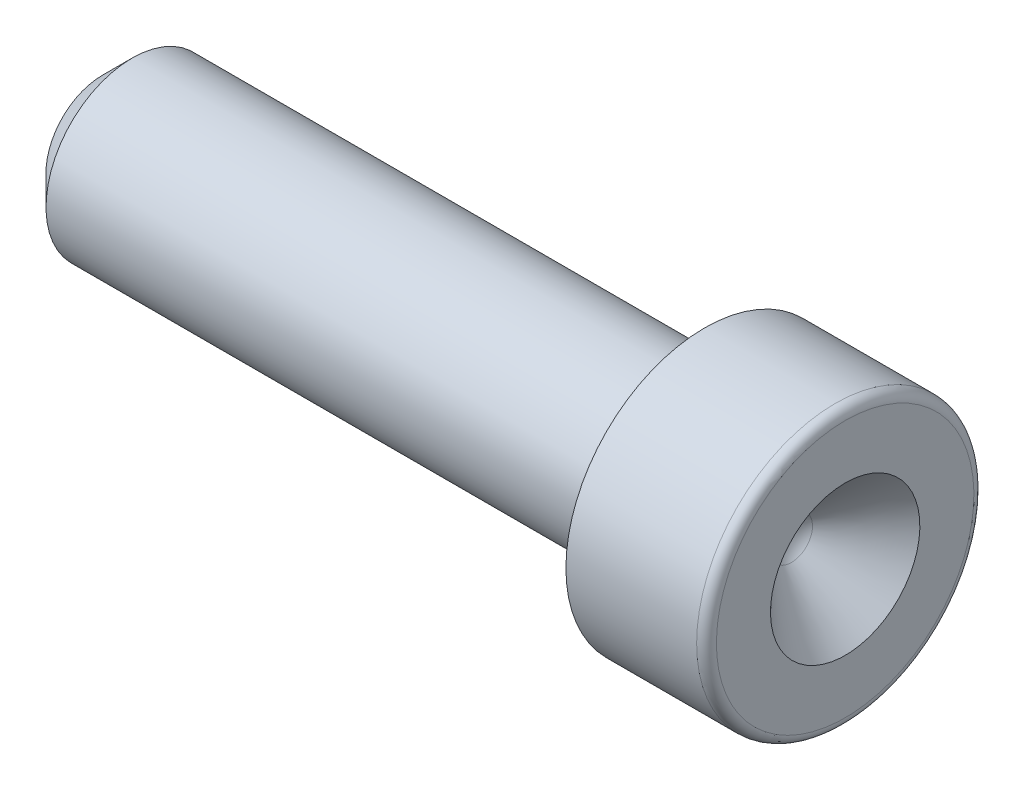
ISO-10303-21;
HEADER;
FILE_DESCRIPTION(('STEP AP214'),'2;1');
FILE_NAME('part.step','',(''),(''),'','','');
FILE_SCHEMA(('AUTOMOTIVE_DESIGN { 1 0 10303 214 1 1 1 1 }'));
ENDSEC;
DATA;
#1=APPLICATION_CONTEXT('core data for automotive mechanical design processes');
#2=APPLICATION_PROTOCOL_DEFINITION('international standard','automotive_design',2000,#1);
#3=PRODUCT_CONTEXT('',#1,'mechanical');
#4=PRODUCT('Part','Part','',(#3));
#5=PRODUCT_RELATED_PRODUCT_CATEGORY('part','',(#4));
#6=PRODUCT_DEFINITION_FORMATION('','',#4);
#7=PRODUCT_DEFINITION_CONTEXT('part definition',#1,'design');
#8=PRODUCT_DEFINITION('design','',#6,#7);
#9=PRODUCT_DEFINITION_SHAPE('','',#8);
#10=(LENGTH_UNIT() NAMED_UNIT(*) SI_UNIT(.MILLI.,.METRE.));
#11=(NAMED_UNIT(*) PLANE_ANGLE_UNIT() SI_UNIT($,.RADIAN.));
#12=(NAMED_UNIT(*) SI_UNIT($,.STERADIAN.) SOLID_ANGLE_UNIT());
#13=UNCERTAINTY_MEASURE_WITH_UNIT(LENGTH_MEASURE(1.E-05),#10,'distance_accuracy_value','');
#14=(GEOMETRIC_REPRESENTATION_CONTEXT(3) GLOBAL_UNCERTAINTY_ASSIGNED_CONTEXT((#13)) GLOBAL_UNIT_ASSIGNED_CONTEXT((#10,
#11,#12)) REPRESENTATION_CONTEXT('',''));
#15=CARTESIAN_POINT('',(0.,0.,0.));
#16=DIRECTION('',(0.,0.,1.));
#17=DIRECTION('',(1.,0.,0.));
#18=AXIS2_PLACEMENT_3D('',#15,#16,#17);
#19=CARTESIAN_POINT('',(19.05,0.,0.));
#20=DIRECTION('',(-1.,0.,0.));
#21=DIRECTION('',(0.,-1.,0.));
#22=AXIS2_PLACEMENT_3D('',#19,#20,#21);
#23=PLANE('',#22);
#24=CARTESIAN_POINT('',(19.05,-2.2098,0.));
#25=DIRECTION('',(1.,0.,0.));
#26=DIRECTION('',(0.,1.,0.));
#27=AXIS2_PLACEMENT_3D('',#24,#25,#26);
#28=CIRCLE('',#27,1.9158307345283);
#29=CARTESIAN_POINT('',(19.05,-0.293969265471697,0.));
#30=VERTEX_POINT('',#29);
#31=EDGE_CURVE('E64',#30,#30,#28,.T.);
#32=ORIENTED_EDGE('',*,*,#31,.F.);
#33=EDGE_LOOP('',(#32));
#34=FACE_BOUND('',#33,.T.);
#35=CARTESIAN_POINT('',(19.05,-2.2098,0.));
#36=DIRECTION('',(1.,0.,0.));
#37=DIRECTION('',(0.,1.,0.));
#38=AXIS2_PLACEMENT_3D('',#35,#36,#37);
#39=CIRCLE('',#38,3.302);
#40=CARTESIAN_POINT('',(19.05,1.0922,0.));
#41=VERTEX_POINT('',#40);
#42=EDGE_CURVE('E10',#41,#41,#39,.T.);
#43=ORIENTED_EDGE('',*,*,#42,.T.);
#44=EDGE_LOOP('',(#43));
#45=FACE_BOUND('',#44,.T.);
#46=ADVANCED_FACE('F33',(#34,#45),#23,.F.);
#47=CARTESIAN_POINT('',(18.796,-2.2098,0.));
#48=DIRECTION('',(1.,0.,0.));
#49=DIRECTION('',(0.,1.,0.));
#50=AXIS2_PLACEMENT_3D('',#47,#48,#49);
#51=TOROIDAL_SURFACE('',#50,3.302,0.254000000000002);
#52=CARTESIAN_POINT('',(18.796,-2.2098,0.));
#53=DIRECTION('',(1.,0.,0.));
#54=DIRECTION('',(0.,1.,0.));
#55=AXIS2_PLACEMENT_3D('',#52,#53,#54);
#56=CIRCLE('',#55,3.556);
#57=CARTESIAN_POINT('',(18.796,1.3462,0.));
#58=VERTEX_POINT('',#57);
#59=EDGE_CURVE('E39',#58,#58,#56,.T.);
#60=ORIENTED_EDGE('',*,*,#59,.T.);
#61=EDGE_LOOP('',(#60));
#62=FACE_BOUND('',#61,.T.);
#63=ORIENTED_EDGE('',*,*,#42,.F.);
#64=EDGE_LOOP('',(#63));
#65=FACE_BOUND('',#64,.T.);
#66=ADVANCED_FACE('F72',(#62,#65),#51,.T.);
#67=CARTESIAN_POINT('',(79.8278326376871,-2.20979999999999,0.));
#68=DIRECTION('',(1.,0.,0.));
#69=DIRECTION('',(0.,1.,0.));
#70=AXIS2_PLACEMENT_3D('',#67,#68,#69);
#71=CYLINDRICAL_SURFACE('',#70,3.556);
#72=ORIENTED_EDGE('',*,*,#59,.F.);
#73=EDGE_LOOP('',(#72));
#74=FACE_BOUND('',#73,.T.);
#75=CARTESIAN_POINT('',(15.4432,-2.2098,0.));
#76=DIRECTION('',(1.,0.,0.));
#77=DIRECTION('',(0.,1.,0.));
#78=AXIS2_PLACEMENT_3D('',#75,#76,#77);
#79=CIRCLE('',#78,3.556);
#80=CARTESIAN_POINT('',(15.4432,1.3462,0.));
#81=VERTEX_POINT('',#80);
#82=EDGE_CURVE('E43',#81,#81,#79,.T.);
#83=ORIENTED_EDGE('',*,*,#82,.T.);
#84=EDGE_LOOP('',(#83));
#85=FACE_BOUND('',#84,.T.);
#86=ADVANCED_FACE('F76',(#74,#85),#71,.T.);
#87=CARTESIAN_POINT('',(15.4432,0.,0.));
#88=DIRECTION('',(1.,0.,0.));
#89=DIRECTION('',(0.,1.,0.));
#90=AXIS2_PLACEMENT_3D('',#87,#88,#89);
#91=PLANE('',#90);
#92=ORIENTED_EDGE('',*,*,#82,.F.);
#93=EDGE_LOOP('',(#92));
#94=FACE_BOUND('',#93,.T.);
#95=CARTESIAN_POINT('',(15.4432,-2.2098,0.));
#96=DIRECTION('',(1.,0.,0.));
#97=DIRECTION('',(0.,1.,0.));
#98=AXIS2_PLACEMENT_3D('',#95,#96,#97);
#99=CIRCLE('',#98,2.7178);
#100=CARTESIAN_POINT('',(15.4432,0.508000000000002,0.));
#101=VERTEX_POINT('',#100);
#102=EDGE_CURVE('E47',#101,#101,#99,.T.);
#103=ORIENTED_EDGE('',*,*,#102,.T.);
#104=EDGE_LOOP('',(#103));
#105=FACE_BOUND('',#104,.T.);
#106=ADVANCED_FACE('F80',(#94,#105),#91,.F.);
#107=CARTESIAN_POINT('',(14.9352,-2.2098,0.));
#108=DIRECTION('',(1.,0.,0.));
#109=DIRECTION('',(0.,1.,0.));
#110=AXIS2_PLACEMENT_3D('',#107,#108,#109);
#111=TOROIDAL_SURFACE('',#110,2.7178,0.508000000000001);
#112=ORIENTED_EDGE('',*,*,#102,.F.);
#113=EDGE_LOOP('',(#112));
#114=FACE_BOUND('',#113,.T.);
#115=CARTESIAN_POINT('',(14.9352,-2.2098,0.));
#116=DIRECTION('',(1.,0.,0.));
#117=DIRECTION('',(0.,1.,0.));
#118=AXIS2_PLACEMENT_3D('',#115,#116,#117);
#119=CIRCLE('',#118,2.2098);
#120=CARTESIAN_POINT('',(14.9352,0.,0.));
#121=VERTEX_POINT('',#120);
#122=EDGE_CURVE('E52',#121,#121,#119,.T.);
#123=ORIENTED_EDGE('',*,*,#122,.T.);
#124=EDGE_LOOP('',(#123));
#125=FACE_BOUND('',#124,.T.);
#126=ADVANCED_FACE('F87',(#114,#125),#111,.F.);
#127=CARTESIAN_POINT('',(79.8278326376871,-2.20979999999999,0.));
#128=DIRECTION('',(1.,0.,0.));
#129=DIRECTION('',(0.,1.,0.));
#130=AXIS2_PLACEMENT_3D('',#127,#128,#129);
#131=CYLINDRICAL_SURFACE('',#130,2.2098);
#132=ORIENTED_EDGE('',*,*,#122,.F.);
#133=EDGE_LOOP('',(#132));
#134=FACE_BOUND('',#133,.T.);
#135=CARTESIAN_POINT('',(0.761999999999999,-2.2098,0.));
#136=DIRECTION('',(1.,0.,0.));
#137=DIRECTION('',(0.,1.,0.));
#138=AXIS2_PLACEMENT_3D('',#135,#136,#137);
#139=CIRCLE('',#138,2.2098);
#140=CARTESIAN_POINT('',(0.761999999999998,0.,0.));
#141=VERTEX_POINT('',#140);
#142=EDGE_CURVE('E55',#141,#141,#139,.T.);
#143=ORIENTED_EDGE('',*,*,#142,.T.);
#144=EDGE_LOOP('',(#143));
#145=FACE_BOUND('',#144,.T.);
#146=ADVANCED_FACE('F91',(#134,#145),#131,.T.);
#147=CARTESIAN_POINT('',(0.,-2.2098,0.));
#148=DIRECTION('',(1.,0.,0.));
#149=DIRECTION('',(0.,1.,0.));
#150=AXIS2_PLACEMENT_3D('',#147,#148,#149);
#151=CONICAL_SURFACE('',#150,1.4478,0.785398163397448);
#152=ORIENTED_EDGE('',*,*,#142,.F.);
#153=EDGE_LOOP('',(#152));
#154=FACE_BOUND('',#153,.T.);
#155=CARTESIAN_POINT('',(0.,-2.2098,0.));
#156=DIRECTION('',(1.,0.,0.));
#157=DIRECTION('',(0.,1.,0.));
#158=AXIS2_PLACEMENT_3D('',#155,#156,#157);
#159=CIRCLE('',#158,1.4478);
#160=CARTESIAN_POINT('',(0.,-0.761999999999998,0.));
#161=VERTEX_POINT('',#160);
#162=EDGE_CURVE('E58',#161,#161,#159,.T.);
#163=ORIENTED_EDGE('',*,*,#162,.T.);
#164=EDGE_LOOP('',(#163));
#165=FACE_BOUND('',#164,.T.);
#166=ADVANCED_FACE('F95',(#154,#165),#151,.T.);
#167=CARTESIAN_POINT('',(0.,0.,0.));
#168=DIRECTION('',(-1.,0.,0.));
#169=DIRECTION('',(0.,-1.,0.));
#170=AXIS2_PLACEMENT_3D('',#167,#168,#169);
#171=PLANE('',#170);
#172=ORIENTED_EDGE('',*,*,#162,.F.);
#173=EDGE_LOOP('',(#172));
#174=FACE_BOUND('',#173,.T.);
#175=ADVANCED_FACE('F99',(#174),#171,.T.);
#176=CARTESIAN_POINT('',(18.2118,-2.2098,0.));
#177=DIRECTION('',(1.,0.,0.));
#178=DIRECTION('',(0.,1.,0.));
#179=AXIS2_PLACEMENT_3D('',#176,#177,#178);
#180=SPHERICAL_SURFACE('',#179,0.762);
#181=CARTESIAN_POINT('',(17.6729846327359,-2.2098,0.));
#182=DIRECTION('',(1.,0.,0.));
#183=DIRECTION('',(0.,1.,0.));
#184=AXIS2_PLACEMENT_3D('',#181,#182,#183);
#185=CIRCLE('',#184,0.538815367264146);
#186=CARTESIAN_POINT('',(17.6729846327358,-1.67098463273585,0.));
#187=VERTEX_POINT('',#186);
#188=EDGE_CURVE('E61',#187,#187,#185,.T.);
#189=ORIENTED_EDGE('',*,*,#188,.T.);
#190=EDGE_LOOP('',(#189));
#191=FACE_BOUND('',#190,.T.);
#192=ADVANCED_FACE('F103',(#191),#180,.F.);
#193=CARTESIAN_POINT('',(17.6729846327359,-2.2098,0.));
#194=DIRECTION('',(1.,0.,0.));
#195=DIRECTION('',(0.,1.,0.));
#196=AXIS2_PLACEMENT_3D('',#193,#194,#195);
#197=CONICAL_SURFACE('',#196,0.538815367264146,0.78539816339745);
#198=CARTESIAN_POINT('',(19.05,-0.293969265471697,0.));
#199=CARTESIAN_POINT('',(19.0356560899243,-0.308313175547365,0.));
#200=CARTESIAN_POINT('',(19.0213121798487,-0.322657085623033,0.));
#201=CARTESIAN_POINT('',(18.9926243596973,-0.35134490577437,0.));
#202=CARTESIAN_POINT('',(18.9782804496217,-0.365688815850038,0.));
#203=CARTESIAN_POINT('',(18.9495926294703,-0.394376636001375,0.));
#204=CARTESIAN_POINT('',(18.9352487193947,-0.408720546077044,0.));
#205=CARTESIAN_POINT('',(18.9065608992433,-0.43740836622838,0.));
#206=CARTESIAN_POINT('',(18.8922169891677,-0.451752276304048,0.));
#207=CARTESIAN_POINT('',(18.8635291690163,-0.480440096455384,0.));
#208=CARTESIAN_POINT('',(18.8491852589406,-0.494784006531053,0.));
#209=CARTESIAN_POINT('',(18.8204974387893,-0.52347182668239,0.));
#210=CARTESIAN_POINT('',(18.8061535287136,-0.537815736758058,0.));
#211=CARTESIAN_POINT('',(18.7774657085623,-0.566503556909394,0.));
#212=CARTESIAN_POINT('',(18.7631217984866,-0.580847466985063,0.));
#213=CARTESIAN_POINT('',(18.7344339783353,-0.6095352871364,0.));
#214=CARTESIAN_POINT('',(18.7200900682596,-0.623879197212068,0.));
#215=CARTESIAN_POINT('',(18.6914022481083,-0.652567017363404,0.));
#216=CARTESIAN_POINT('',(18.6770583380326,-0.666910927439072,0.));
#217=CARTESIAN_POINT('',(18.6483705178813,-0.695598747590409,0.));
#218=CARTESIAN_POINT('',(18.6340266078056,-0.709942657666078,0.));
#219=CARTESIAN_POINT('',(18.6053387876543,-0.738630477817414,0.));
#220=CARTESIAN_POINT('',(18.5909948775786,-0.752974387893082,0.));
#221=CARTESIAN_POINT('',(18.5623070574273,-0.781662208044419,0.));
#222=CARTESIAN_POINT('',(18.5479631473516,-0.796006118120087,0.));
#223=CARTESIAN_POINT('',(18.5192753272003,-0.824693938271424,0.));
#224=CARTESIAN_POINT('',(18.5049314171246,-0.839037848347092,0.));
#225=CARTESIAN_POINT('',(18.4762435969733,-0.867725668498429,0.));
#226=CARTESIAN_POINT('',(18.4618996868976,-0.882069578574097,0.));
#227=CARTESIAN_POINT('',(18.4332118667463,-0.910757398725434,0.));
#228=CARTESIAN_POINT('',(18.4188679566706,-0.925101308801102,0.));
#229=CARTESIAN_POINT('',(18.3901801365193,-0.953789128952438,0.));
#230=CARTESIAN_POINT('',(18.3758362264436,-0.968133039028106,0.));
#231=CARTESIAN_POINT('',(18.3471484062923,-0.996820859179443,0.));
#232=CARTESIAN_POINT('',(18.3328044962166,-1.01116476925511,0.));
#233=CARTESIAN_POINT('',(18.3041166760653,-1.03985258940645,0.));
#234=CARTESIAN_POINT('',(18.2897727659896,-1.05419649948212,0.));
#235=CARTESIAN_POINT('',(18.2610849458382,-1.08288431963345,0.));
#236=CARTESIAN_POINT('',(18.2467410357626,-1.09722822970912,0.));
#237=CARTESIAN_POINT('',(18.2180532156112,-1.12591604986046,0.));
#238=CARTESIAN_POINT('',(18.2037093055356,-1.14025995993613,0.));
#239=CARTESIAN_POINT('',(18.1750214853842,-1.16894778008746,0.));
#240=CARTESIAN_POINT('',(18.1606775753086,-1.18329169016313,0.));
#241=CARTESIAN_POINT('',(18.1319897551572,-1.21197951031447,0.));
#242=CARTESIAN_POINT('',(18.1176458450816,-1.22632342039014,0.));
#243=CARTESIAN_POINT('',(18.0889580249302,-1.25501124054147,0.));
#244=CARTESIAN_POINT('',(18.0746141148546,-1.26935515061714,0.));
#245=CARTESIAN_POINT('',(18.0459262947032,-1.29804297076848,0.));
#246=CARTESIAN_POINT('',(18.0315823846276,-1.31238688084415,0.));
#247=CARTESIAN_POINT('',(18.0028945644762,-1.34107470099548,0.));
#248=CARTESIAN_POINT('',(17.9885506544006,-1.35541861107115,0.));
#249=CARTESIAN_POINT('',(17.9598628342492,-1.38410643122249,0.));
#250=CARTESIAN_POINT('',(17.9455189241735,-1.39845034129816,0.));
#251=CARTESIAN_POINT('',(17.9168311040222,-1.42713816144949,0.));
#252=CARTESIAN_POINT('',(17.9024871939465,-1.44148207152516,0.));
#253=CARTESIAN_POINT('',(17.8737993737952,-1.4701698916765,0.));
#254=CARTESIAN_POINT('',(17.8594554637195,-1.48451380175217,0.));
#255=CARTESIAN_POINT('',(17.8307676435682,-1.5132016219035,0.));
#256=CARTESIAN_POINT('',(17.8164237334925,-1.52754553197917,0.));
#257=CARTESIAN_POINT('',(17.7877359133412,-1.55623335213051,0.));
#258=CARTESIAN_POINT('',(17.7733920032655,-1.57057726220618,0.));
#259=CARTESIAN_POINT('',(17.7447041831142,-1.59926508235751,0.));
#260=CARTESIAN_POINT('',(17.7303602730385,-1.61360899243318,0.));
#261=CARTESIAN_POINT('',(17.7016724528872,-1.64229681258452,0.));
#262=CARTESIAN_POINT('',(17.6873285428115,-1.65664072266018,0.));
#263=CARTESIAN_POINT('',(17.6729846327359,-1.67098463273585,0.));
#264=B_SPLINE_CURVE_WITH_KNOTS('',3,(#198,#199,#200,#201,#202,#203,#204,#205,#206,#207,#208,
#209,#210,#211,#212,#213,#214,#215,#216,#217,#218,#219,#220,#221,#222,#223,#224,#225,#226,#227,
#228,#229,#230,#231,#232,#233,#234,#235,#236,#237,#238,#239,#240,#241,#242,#243,#244,#245,#246,
#247,#248,#249,#250,#251,#252,#253,#254,#255,#256,#257,#258,#259,#260,#261,#262,#263),
.UNSPECIFIED.,.F.,.F.,(4,2,2,2,2,2,2,2,2,2,2,2,2,2,2,2,2,2,2,2,2,2,2,2,2,2,2,2,2,2,2,2,4),(0.,
0.0608560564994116,0.121712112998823,0.182568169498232,0.243424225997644,0.304280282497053,
0.365136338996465,0.425992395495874,0.486848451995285,0.547704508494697,0.608560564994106,
0.669416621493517,0.730272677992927,0.791128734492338,0.851984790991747,0.912840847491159,
0.97369690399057,1.03455296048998,1.09540901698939,1.1562650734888,1.21712112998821,
1.27797718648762,1.33883324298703,1.39968929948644,1.46054535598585,1.52140141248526,
1.58225746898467,1.64311352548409,1.70396958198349,1.76482563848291,1.82568169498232,
1.88653775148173,1.94739380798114),.UNSPECIFIED.);
#265=EDGE_CURVE('BSEAM68',#30,#187,#264,.T.);
#266=ORIENTED_EDGE('',*,*,#31,.T.);
#267=ORIENTED_EDGE('',*,*,#188,.F.);
#268=ORIENTED_EDGE('',*,*,#265,.T.);
#269=ORIENTED_EDGE('',*,*,#265,.F.);
#270=EDGE_LOOP('',(#266,#268,#267,#269));
#271=FACE_BOUND('',#270,.T.);
#272=ADVANCED_FACE('F68',(#271),#197,.F.);
#273=CLOSED_SHELL('',(#46,#66,#86,#106,#126,#146,#166,#175,#192,#272));
#274=MANIFOLD_SOLID_BREP('B2',#273);
#275=ADVANCED_BREP_SHAPE_REPRESENTATION('',(#18,#274),#14);
#276=SHAPE_DEFINITION_REPRESENTATION(#9,#275);
ENDSEC;
END-ISO-10303-21;
